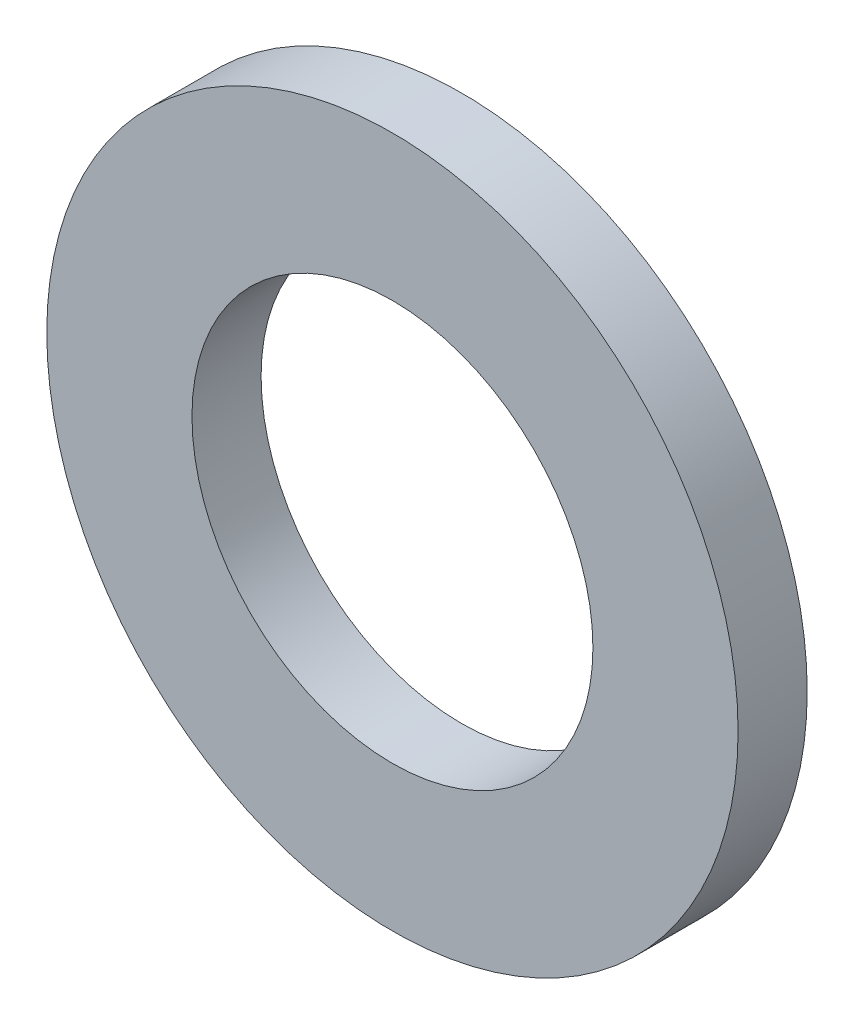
from build123d import *

# Parameters (mm, degrees)
ESQUISSE1_R      = 12.5
ESQUISSE1_R_2    = 7.25
EXTRUSION1_DEPTH = 2.5


with BuildPart() as part:
    # Esquisse1 → Extrusion1 (new body)
    with BuildSketch(Plane.XY):
        Circle(ESQUISSE1_R)
        Circle(ESQUISSE1_R_2, mode=Mode.SUBTRACT)
    extrude(amount=EXTRUSION1_DEPTH)


solid = part.part
